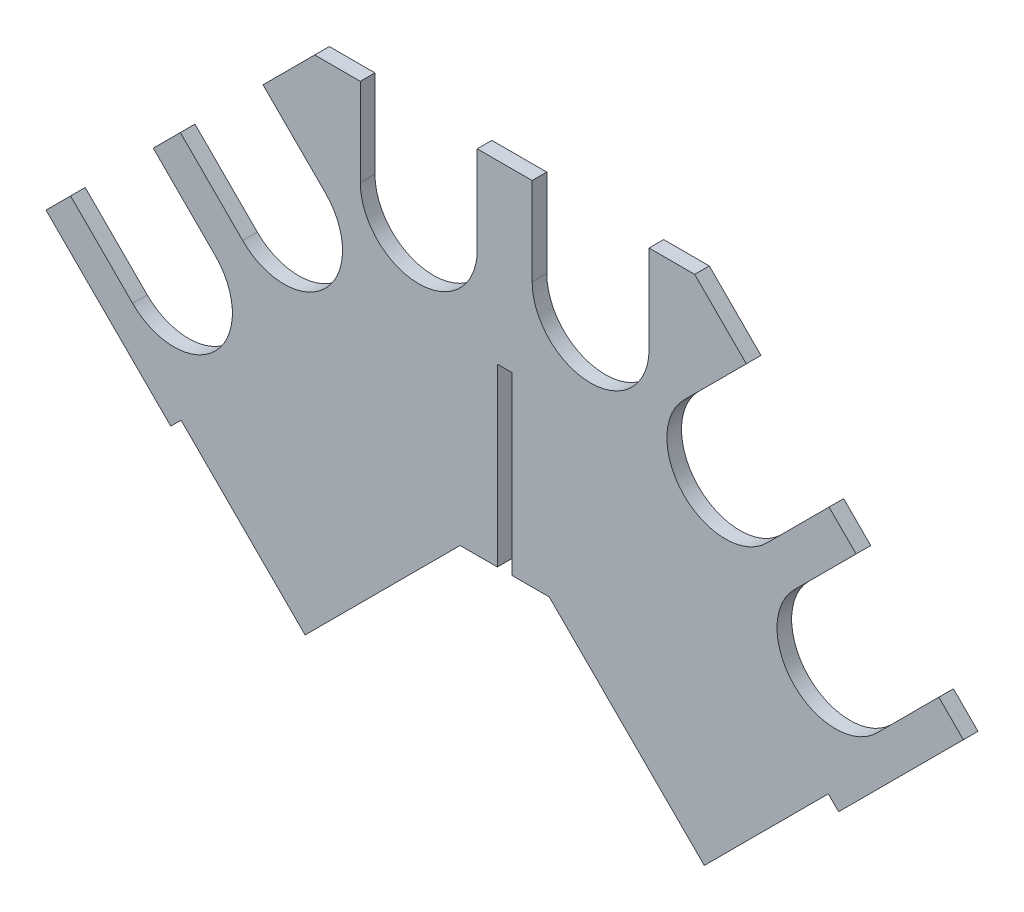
from build123d import *

# Parameters (mm, degrees)
SKETCH1_R          = 50.8
EXTRUDE1_DEPTH     = 12.7
CUT_EXTRUDE1_REACH = 749.362


with BuildPart() as part:
    # Sketch1 → Extrude1 (new body)
    with BuildSketch(Plane.XY):
        Polygon((-6.35, 478.770757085), (6.35, 478.770757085), (6.35, 326.106403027), (38.738207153, 326.106403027), (173.442048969, 191.402561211), (281.205122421, 299.165634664), (290.185378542, 290.185378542), (398.586659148, 398.586659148), (165.1, 632.073318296), (-165.1, 632.073318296), (-398.586659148, 398.586659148), (-290.185378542, 290.185378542), (-281.205122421, 299.165634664), (-173.442048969, 191.402561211), (-38.738207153, 326.106403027), (-6.35, 326.106403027), align=None)
        with Locations((287.422945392, 401.98729945)):
            Circle(SKETCH1_R, mode=Mode.SUBTRACT)
        with Locations((-287.422945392, 401.98729945)):
            Circle(SKETCH1_R, mode=Mode.SUBTRACT)
        with Locations((-191.721664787, 497.050372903)):
            Circle(SKETCH1_R, mode=Mode.SUBTRACT)
        with Locations((191.721664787, 497.050372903)):
            Circle(SKETCH1_R, mode=Mode.SUBTRACT)
        with Locations((74.659231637, 555.873318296)):
            Circle(SKETCH1_R, mode=Mode.SUBTRACT)
        with Locations((-74.659231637, 555.873318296)):
            Circle(SKETCH1_R, mode=Mode.SUBTRACT)
    extrude(amount=EXTRUDE1_DEPTH)

    # Sketch2 → Cut-Extrude1 (cut, up to next)
    with BuildSketch(Plane.XY.offset(12.7), mode=Mode.PRIVATE) as cut_extrude1_sk1:
        with BuildLine():
            Line((251.501920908, 437.908323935), (305.383457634, 491.789860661))
            Line((305.383457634, 491.789860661), (377.225506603, 419.947811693))
            Line((377.225506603, 419.947811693), (323.343969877, 366.066274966))
            ThreePointArc((323.343969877, 366.066274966), (323.343969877, 437.908323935), (251.501920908, 437.908323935))
        make_face()
    cut_extrude1_tool1 = extrude(cut_extrude1_sk1.sketch, amount=-CUT_EXTRUDE1_REACH, mode=Mode.PRIVATE) & part.part
    # Sketch2 → Cut-Extrude1 (cut, up to next)
    with BuildSketch(Plane.XY.offset(12.7), mode=Mode.PRIVATE) as cut_extrude1_sk2:
        with BuildLine():
            Line((227.642689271, 461.129348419), (281.843329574, 515.329988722))
            Line((281.843329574, 515.329988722), (210.001280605, 587.17203769))
            Line((210.001280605, 587.17203769), (155.800640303, 532.971397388))
            ThreePointArc((155.800640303, 532.971397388), (227.642689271, 532.971397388), (227.642689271, 461.129348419))
        make_face()
    cut_extrude1_tool2 = extrude(cut_extrude1_sk2.sketch, amount=-CUT_EXTRUDE1_REACH, mode=Mode.PRIVATE) & part.part
    # Sketch2 → Cut-Extrude1 (cut, up to next)
    with BuildSketch(Plane.XY.offset(12.7), mode=Mode.PRIVATE) as cut_extrude1_sk3:
        with BuildLine():
            Line((125.459231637, 632.073318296), (125.459231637, 555.873318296))
            ThreePointArc((125.459231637, 555.873318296), (74.659231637, 606.673318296), (23.859231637, 555.873318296))
            Line((23.859231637, 555.873318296), (23.859231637, 632.073318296))
            Line((23.859231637, 632.073318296), (125.459231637, 632.073318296))
        make_face()
    cut_extrude1_tool3 = extrude(cut_extrude1_sk3.sketch, amount=-CUT_EXTRUDE1_REACH, mode=Mode.PRIVATE) & part.part
    # Sketch2 → Cut-Extrude1 (cut, up to next)
    with BuildSketch(Plane.XY.offset(12.7), mode=Mode.PRIVATE) as cut_extrude1_sk4:
        with BuildLine():
            Line((-23.859231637, 632.073318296), (-23.859231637, 555.873318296))
            ThreePointArc((-23.859231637, 555.873318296), (-74.659231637, 606.673318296), (-125.459231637, 555.873318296))
            Line((-125.459231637, 555.873318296), (-125.459231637, 632.073318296))
            Line((-125.459231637, 632.073318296), (-23.859231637, 632.073318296))
        make_face()
    cut_extrude1_tool4 = extrude(cut_extrude1_sk4.sketch, amount=-CUT_EXTRUDE1_REACH, mode=Mode.PRIVATE) & part.part
    # Sketch2 → Cut-Extrude1 (cut, up to next)
    with BuildSketch(Plane.XY.offset(12.7), mode=Mode.PRIVATE) as cut_extrude1_sk5:
        with BuildLine():
            Line((-210.001280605, 587.17203769), (-155.800640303, 532.971397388))
            ThreePointArc((-155.800640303, 532.971397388), (-227.642689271, 532.971397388), (-227.642689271, 461.129348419))
            Line((-227.642689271, 461.129348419), (-281.843329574, 515.329988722))
            Line((-281.843329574, 515.329988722), (-210.001280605, 587.17203769))
        make_face()
    cut_extrude1_tool5 = extrude(cut_extrude1_sk5.sketch, amount=-CUT_EXTRUDE1_REACH, mode=Mode.PRIVATE) & part.part
    # Sketch2 → Cut-Extrude1 (cut, up to next)
    with BuildSketch(Plane.XY.offset(12.7), mode=Mode.PRIVATE) as cut_extrude1_sk6:
        with BuildLine():
            Line((-305.383457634, 491.789860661), (-251.501920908, 437.908323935))
            ThreePointArc((-251.501920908, 437.908323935), (-323.343969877, 437.908323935), (-323.343969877, 366.066274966))
            Line((-323.343969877, 366.066274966), (-377.225506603, 419.947811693))
            Line((-377.225506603, 419.947811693), (-305.383457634, 491.789860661))
        make_face()
    cut_extrude1_tool6 = extrude(cut_extrude1_sk6.sketch, amount=-CUT_EXTRUDE1_REACH, mode=Mode.PRIVATE) & part.part
    add(cut_extrude1_tool1.solids().sort_by_distance((327.217802, 441.782156, 12.7))[0], mode=Mode.SUBTRACT)
    add(cut_extrude1_tool2.solids().sort_by_distance((231.691447, 537.020155, 12.7))[0], mode=Mode.SUBTRACT)
    add(cut_extrude1_tool3.solids().sort_by_distance((74.659232, 612.151744, 12.7))[0], mode=Mode.SUBTRACT)
    add(cut_extrude1_tool4.solids().sort_by_distance((-74.659232, 612.151744, 12.7))[0], mode=Mode.SUBTRACT)
    add(cut_extrude1_tool5.solids().sort_by_distance((-231.691447, 537.020155, 12.7))[0], mode=Mode.SUBTRACT)
    add(cut_extrude1_tool6.solids().sort_by_distance((-327.217802, 441.782156, 12.7))[0], mode=Mode.SUBTRACT)


solid = part.part
